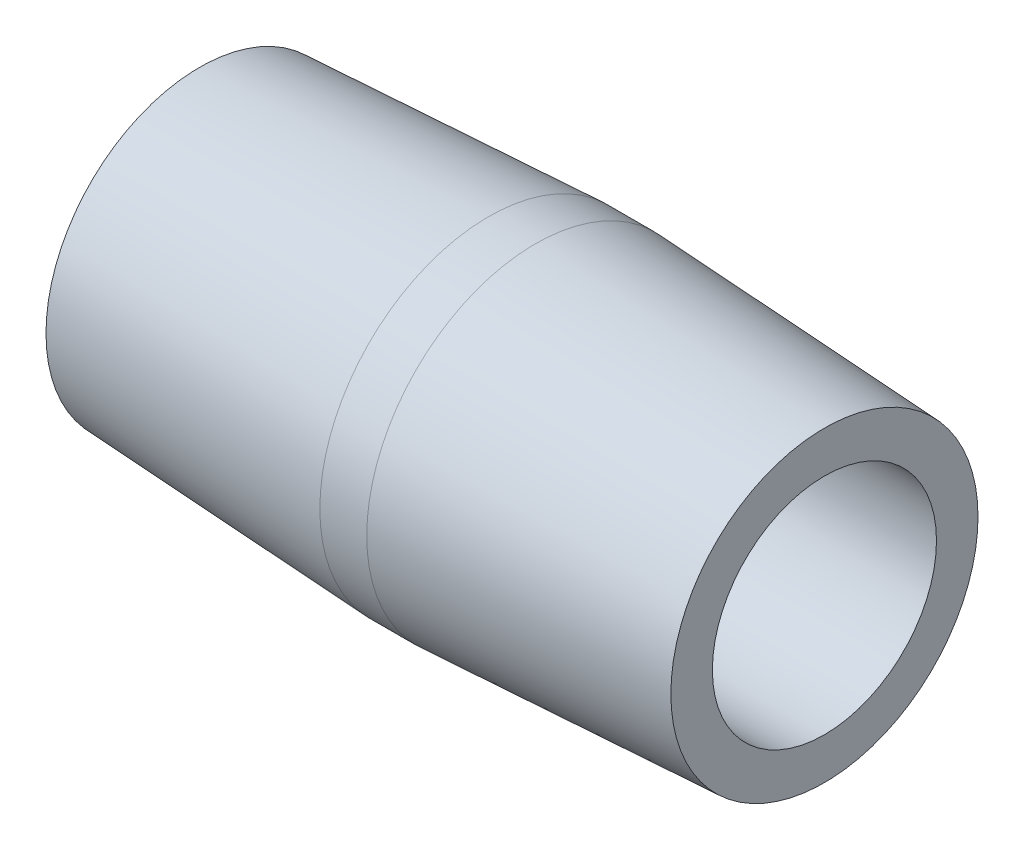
ISO-10303-21;
HEADER;
FILE_DESCRIPTION(('STEP AP214'),'2;1');
FILE_NAME('part.step','',(''),(''),'','','');
FILE_SCHEMA(('AUTOMOTIVE_DESIGN { 1 0 10303 214 1 1 1 1 }'));
ENDSEC;
DATA;
#1=APPLICATION_CONTEXT('core data for automotive mechanical design processes');
#2=APPLICATION_PROTOCOL_DEFINITION('international standard','automotive_design',2000,#1);
#3=PRODUCT_CONTEXT('',#1,'mechanical');
#4=PRODUCT('Part','Part','',(#3));
#5=PRODUCT_RELATED_PRODUCT_CATEGORY('part','',(#4));
#6=PRODUCT_DEFINITION_FORMATION('','',#4);
#7=PRODUCT_DEFINITION_CONTEXT('part definition',#1,'design');
#8=PRODUCT_DEFINITION('design','',#6,#7);
#9=PRODUCT_DEFINITION_SHAPE('','',#8);
#10=(LENGTH_UNIT() NAMED_UNIT(*) SI_UNIT(.MILLI.,.METRE.));
#11=(NAMED_UNIT(*) PLANE_ANGLE_UNIT() SI_UNIT($,.RADIAN.));
#12=(NAMED_UNIT(*) SI_UNIT($,.STERADIAN.) SOLID_ANGLE_UNIT());
#13=UNCERTAINTY_MEASURE_WITH_UNIT(LENGTH_MEASURE(1.E-05),#10,'distance_accuracy_value','');
#14=(GEOMETRIC_REPRESENTATION_CONTEXT(3) GLOBAL_UNCERTAINTY_ASSIGNED_CONTEXT((#13)) GLOBAL_UNIT_ASSIGNED_CONTEXT((#10,
#11,#12)) REPRESENTATION_CONTEXT('',''));
#15=CARTESIAN_POINT('',(0.,0.,0.));
#16=DIRECTION('',(0.,0.,1.));
#17=DIRECTION('',(1.,0.,0.));
#18=AXIS2_PLACEMENT_3D('',#15,#16,#17);
#19=CARTESIAN_POINT('',(0.476141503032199,0.,0.));
#20=DIRECTION('',(-1.,0.,0.));
#21=DIRECTION('',(0.,0.,1.));
#22=AXIS2_PLACEMENT_3D('',#19,#20,#21);
#23=CYLINDRICAL_SURFACE('',#22,5.14349999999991);
#24=CARTESIAN_POINT('',(8.8100393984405,0.,0.));
#25=DIRECTION('',(-1.,0.,0.));
#26=DIRECTION('',(0.,0.,1.));
#27=AXIS2_PLACEMENT_3D('',#24,#25,#26);
#28=CIRCLE('',#27,5.14349999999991);
#29=CARTESIAN_POINT('',(8.8100393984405,0.,5.14349999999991));
#30=VERTEX_POINT('',#29);
#31=EDGE_CURVE('E10',#30,#30,#28,.T.);
#32=ORIENTED_EDGE('',*,*,#31,.F.);
#33=EDGE_LOOP('',(#32));
#34=FACE_BOUND('',#33,.T.);
#35=CARTESIAN_POINT('',(10.2399606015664,0.,0.));
#36=DIRECTION('',(-1.,0.,0.));
#37=DIRECTION('',(0.,0.,1.));
#38=AXIS2_PLACEMENT_3D('',#35,#36,#37);
#39=CIRCLE('',#38,5.14349999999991);
#40=CARTESIAN_POINT('',(10.2399606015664,0.,5.14349999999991));
#41=VERTEX_POINT('',#40);
#42=EDGE_CURVE('E52',#41,#41,#39,.T.);
#43=ORIENTED_EDGE('',*,*,#42,.T.);
#44=EDGE_LOOP('',(#43));
#45=FACE_BOUND('',#44,.T.);
#46=ADVANCED_FACE('F30',(#34,#45),#23,.T.);
#47=CARTESIAN_POINT('',(8.8100393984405,0.,0.));
#48=DIRECTION('',(1.,0.,0.));
#49=DIRECTION('',(0.,0.,-1.));
#50=AXIS2_PLACEMENT_3D('',#47,#48,#49);
#51=CONICAL_SURFACE('',#50,5.14349999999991,0.0523598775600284);
#52=CARTESIAN_POINT('',(0.,0.,0.));
#53=DIRECTION('',(-1.,0.,0.));
#54=DIRECTION('',(0.,0.,1.));
#55=AXIS2_PLACEMENT_3D('',#52,#53,#54);
#56=CIRCLE('',#55,4.68178539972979);
#57=CARTESIAN_POINT('',(0.,0.,4.68178539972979));
#58=VERTEX_POINT('',#57);
#59=EDGE_CURVE('E36',#58,#58,#56,.T.);
#60=ORIENTED_EDGE('',*,*,#59,.F.);
#61=EDGE_LOOP('',(#60));
#62=FACE_BOUND('',#61,.T.);
#63=ORIENTED_EDGE('',*,*,#31,.T.);
#64=EDGE_LOOP('',(#63));
#65=FACE_BOUND('',#64,.T.);
#66=ADVANCED_FACE('F77',(#62,#65),#51,.T.);
#67=CARTESIAN_POINT('',(0.,4.68178539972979,0.));
#68=DIRECTION('',(1.,0.,0.));
#69=DIRECTION('',(0.,0.,-1.));
#70=AXIS2_PLACEMENT_3D('',#67,#68,#69);
#71=PLANE('',#70);
#72=CARTESIAN_POINT('',(0.,0.,0.));
#73=DIRECTION('',(-1.,0.,0.));
#74=DIRECTION('',(0.,0.,1.));
#75=AXIS2_PLACEMENT_3D('',#72,#73,#74);
#76=CIRCLE('',#75,3.4163);
#77=CARTESIAN_POINT('',(0.,0.,3.4163));
#78=VERTEX_POINT('',#77);
#79=EDGE_CURVE('E40',#78,#78,#76,.T.);
#80=ORIENTED_EDGE('',*,*,#79,.F.);
#81=EDGE_LOOP('',(#80));
#82=FACE_BOUND('',#81,.T.);
#83=ORIENTED_EDGE('',*,*,#59,.T.);
#84=EDGE_LOOP('',(#83));
#85=FACE_BOUND('',#84,.T.);
#86=ADVANCED_FACE('F72',(#82,#85),#71,.F.);
#87=CARTESIAN_POINT('',(0.476141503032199,0.,0.));
#88=DIRECTION('',(-1.,0.,0.));
#89=DIRECTION('',(0.,0.,1.));
#90=AXIS2_PLACEMENT_3D('',#87,#88,#89);
#91=CYLINDRICAL_SURFACE('',#90,3.4163);
#92=CARTESIAN_POINT('',(19.05,0.,0.));
#93=DIRECTION('',(-1.,0.,0.));
#94=DIRECTION('',(0.,0.,1.));
#95=AXIS2_PLACEMENT_3D('',#92,#93,#94);
#96=CIRCLE('',#95,3.4163);
#97=CARTESIAN_POINT('',(19.05,0.,3.4163));
#98=VERTEX_POINT('',#97);
#99=EDGE_CURVE('E44',#98,#98,#96,.T.);
#100=ORIENTED_EDGE('',*,*,#99,.F.);
#101=EDGE_LOOP('',(#100));
#102=FACE_BOUND('',#101,.T.);
#103=ORIENTED_EDGE('',*,*,#79,.T.);
#104=EDGE_LOOP('',(#103));
#105=FACE_BOUND('',#104,.T.);
#106=ADVANCED_FACE('F66',(#102,#105),#91,.F.);
#107=CARTESIAN_POINT('',(19.05,3.4163,0.));
#108=DIRECTION('',(-1.,0.,0.));
#109=DIRECTION('',(0.,0.,1.));
#110=AXIS2_PLACEMENT_3D('',#107,#108,#109);
#111=PLANE('',#110);
#112=CARTESIAN_POINT('',(19.05,0.,0.));
#113=DIRECTION('',(-1.,0.,0.));
#114=DIRECTION('',(0.,0.,1.));
#115=AXIS2_PLACEMENT_3D('',#112,#113,#114);
#116=CIRCLE('',#115,4.68178539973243);
#117=CARTESIAN_POINT('',(19.05,0.,4.68178539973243));
#118=VERTEX_POINT('',#117);
#119=EDGE_CURVE('E49',#118,#118,#116,.T.);
#120=ORIENTED_EDGE('',*,*,#119,.F.);
#121=EDGE_LOOP('',(#120));
#122=FACE_BOUND('',#121,.T.);
#123=ORIENTED_EDGE('',*,*,#99,.T.);
#124=EDGE_LOOP('',(#123));
#125=FACE_BOUND('',#124,.T.);
#126=ADVANCED_FACE('F60',(#122,#125),#111,.F.);
#127=CARTESIAN_POINT('',(19.05,0.,0.));
#128=DIRECTION('',(-1.,0.,0.));
#129=DIRECTION('',(0.,0.,1.));
#130=AXIS2_PLACEMENT_3D('',#127,#128,#129);
#131=CONICAL_SURFACE('',#130,4.68178539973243,0.0523598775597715);
#132=ORIENTED_EDGE('',*,*,#42,.F.);
#133=EDGE_LOOP('',(#132));
#134=FACE_BOUND('',#133,.T.);
#135=ORIENTED_EDGE('',*,*,#119,.T.);
#136=EDGE_LOOP('',(#135));
#137=FACE_BOUND('',#136,.T.);
#138=ADVANCED_FACE('F57',(#134,#137),#131,.T.);
#139=CLOSED_SHELL('',(#46,#66,#86,#106,#126,#138));
#140=MANIFOLD_SOLID_BREP('B2',#139);
#141=ADVANCED_BREP_SHAPE_REPRESENTATION('',(#18,#140),#14);
#142=SHAPE_DEFINITION_REPRESENTATION(#9,#141);
ENDSEC;
END-ISO-10303-21;
